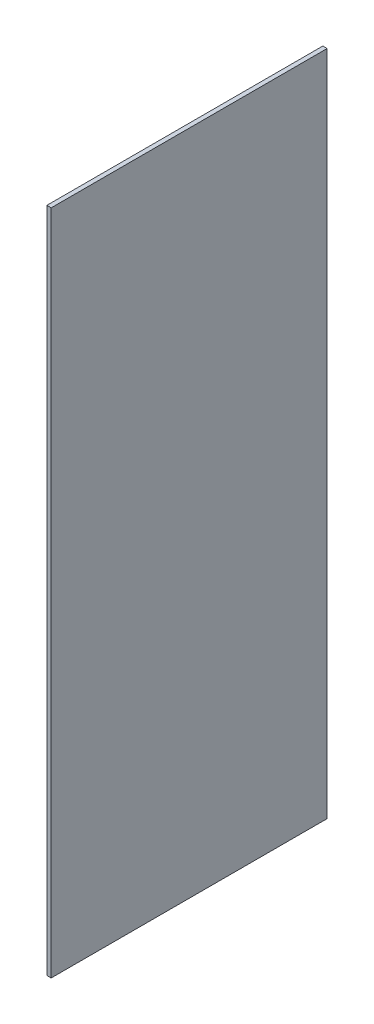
ISO-10303-21;
HEADER;
FILE_DESCRIPTION(('STEP AP214'),'2;1');
FILE_NAME('part.step','',(''),(''),'','','');
FILE_SCHEMA(('AUTOMOTIVE_DESIGN { 1 0 10303 214 1 1 1 1 }'));
ENDSEC;
DATA;
#1=APPLICATION_CONTEXT('core data for automotive mechanical design processes');
#2=APPLICATION_PROTOCOL_DEFINITION('international standard','automotive_design',2000,#1);
#3=PRODUCT_CONTEXT('',#1,'mechanical');
#4=PRODUCT('Part','Part','',(#3));
#5=PRODUCT_RELATED_PRODUCT_CATEGORY('part','',(#4));
#6=PRODUCT_DEFINITION_FORMATION('','',#4);
#7=PRODUCT_DEFINITION_CONTEXT('part definition',#1,'design');
#8=PRODUCT_DEFINITION('design','',#6,#7);
#9=PRODUCT_DEFINITION_SHAPE('','',#8);
#10=(LENGTH_UNIT() NAMED_UNIT(*) SI_UNIT(.MILLI.,.METRE.));
#11=(NAMED_UNIT(*) PLANE_ANGLE_UNIT() SI_UNIT($,.RADIAN.));
#12=(NAMED_UNIT(*) SI_UNIT($,.STERADIAN.) SOLID_ANGLE_UNIT());
#13=UNCERTAINTY_MEASURE_WITH_UNIT(LENGTH_MEASURE(1.E-05),#10,'distance_accuracy_value','');
#14=(GEOMETRIC_REPRESENTATION_CONTEXT(3) GLOBAL_UNCERTAINTY_ASSIGNED_CONTEXT((#13)) GLOBAL_UNIT_ASSIGNED_CONTEXT((#10,
#11,#12)) REPRESENTATION_CONTEXT('',''));
#15=CARTESIAN_POINT('',(0.,0.,0.));
#16=DIRECTION('',(0.,0.,1.));
#17=DIRECTION('',(1.,0.,0.));
#18=AXIS2_PLACEMENT_3D('',#15,#16,#17);
#19=CARTESIAN_POINT('',(-4.76249999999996,1473.2,304.8));
#20=DIRECTION('',(1.,0.,0.));
#21=DIRECTION('',(0.,0.,-1.));
#22=AXIS2_PLACEMENT_3D('',#19,#20,#21);
#23=PLANE('',#22);
#24=DIRECTION('',(0.,0.,1.));
#25=VECTOR('',#24,1.);
#26=CARTESIAN_POINT('',(-4.76249999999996,0.,304.8));
#27=LINE('',#26,#25);
#28=CARTESIAN_POINT('',(-4.76250000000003,0.,-304.8));
#29=VERTEX_POINT('',#28);
#30=CARTESIAN_POINT('',(-4.76249999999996,0.,304.8));
#31=VERTEX_POINT('',#30);
#32=EDGE_CURVE('E113',#29,#31,#27,.T.);
#33=ORIENTED_EDGE('',*,*,#32,.T.);
#34=DIRECTION('',(0.,-1.,0.));
#35=VECTOR('',#34,1.);
#36=CARTESIAN_POINT('',(-4.76249999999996,1473.2,304.8));
#37=LINE('',#36,#35);
#38=CARTESIAN_POINT('',(-4.76249999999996,1473.2,304.8));
#39=VERTEX_POINT('',#38);
#40=EDGE_CURVE('E11',#39,#31,#37,.T.);
#41=ORIENTED_EDGE('',*,*,#40,.F.);
#42=DIRECTION('',(0.,0.,1.));
#43=VECTOR('',#42,1.);
#44=CARTESIAN_POINT('',(-4.76249999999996,1473.2,304.8));
#45=LINE('',#44,#43);
#46=CARTESIAN_POINT('',(-4.76250000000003,1473.2,-304.8));
#47=VERTEX_POINT('',#46);
#48=EDGE_CURVE('E97',#47,#39,#45,.T.);
#49=ORIENTED_EDGE('',*,*,#48,.F.);
#50=DIRECTION('',(0.,-1.,0.));
#51=VECTOR('',#50,1.);
#52=CARTESIAN_POINT('',(-4.76250000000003,1473.2,-304.8));
#53=LINE('',#52,#51);
#54=EDGE_CURVE('E107',#47,#29,#53,.T.);
#55=ORIENTED_EDGE('',*,*,#54,.T.);
#56=EDGE_LOOP('',(#33,#41,#49,#55));
#57=FACE_BOUND('',#56,.T.);
#58=ADVANCED_FACE('F44',(#57),#23,.F.);
#59=CARTESIAN_POINT('',(4.76250000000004,1473.2,304.8));
#60=DIRECTION('',(0.,0.,-1.));
#61=DIRECTION('',(-1.,0.,0.));
#62=AXIS2_PLACEMENT_3D('',#59,#60,#61);
#63=PLANE('',#62);
#64=DIRECTION('',(1.,0.,0.));
#65=VECTOR('',#64,1.);
#66=CARTESIAN_POINT('',(4.76250000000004,0.,304.8));
#67=LINE('',#66,#65);
#68=CARTESIAN_POINT('',(4.76250000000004,0.,304.8));
#69=VERTEX_POINT('',#68);
#70=EDGE_CURVE('E105',#31,#69,#67,.T.);
#71=ORIENTED_EDGE('',*,*,#70,.T.);
#72=DIRECTION('',(0.,-1.,0.));
#73=VECTOR('',#72,1.);
#74=CARTESIAN_POINT('',(4.76250000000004,1473.2,304.8));
#75=LINE('',#74,#73);
#76=CARTESIAN_POINT('',(4.76250000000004,1473.2,304.8));
#77=VERTEX_POINT('',#76);
#78=EDGE_CURVE('E53',#77,#69,#75,.T.);
#79=ORIENTED_EDGE('',*,*,#78,.F.);
#80=DIRECTION('',(1.,0.,0.));
#81=VECTOR('',#80,1.);
#82=CARTESIAN_POINT('',(4.76250000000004,1473.2,304.8));
#83=LINE('',#82,#81);
#84=EDGE_CURVE('E95',#39,#77,#83,.T.);
#85=ORIENTED_EDGE('',*,*,#84,.F.);
#86=ORIENTED_EDGE('',*,*,#40,.T.);
#87=EDGE_LOOP('',(#71,#79,#85,#86));
#88=FACE_BOUND('',#87,.T.);
#89=ADVANCED_FACE('F103',(#88),#63,.F.);
#90=CARTESIAN_POINT('',(4.76250000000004,1473.2,304.8));
#91=DIRECTION('',(-1.,0.,0.));
#92=DIRECTION('',(0.,0.,1.));
#93=AXIS2_PLACEMENT_3D('',#90,#91,#92);
#94=PLANE('',#93);
#95=DIRECTION('',(0.,0.,-1.));
#96=VECTOR('',#95,1.);
#97=CARTESIAN_POINT('',(4.76250000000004,0.,304.8));
#98=LINE('',#97,#96);
#99=CARTESIAN_POINT('',(4.76249999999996,0.,-304.8));
#100=VERTEX_POINT('',#99);
#101=EDGE_CURVE('E79',#69,#100,#98,.T.);
#102=ORIENTED_EDGE('',*,*,#101,.T.);
#103=DIRECTION('',(0.,-1.,0.));
#104=VECTOR('',#103,1.);
#105=CARTESIAN_POINT('',(4.76249999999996,1473.2,-304.8));
#106=LINE('',#105,#104);
#107=CARTESIAN_POINT('',(4.76249999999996,1473.2,-304.8));
#108=VERTEX_POINT('',#107);
#109=EDGE_CURVE('E104',#108,#100,#106,.T.);
#110=ORIENTED_EDGE('',*,*,#109,.F.);
#111=DIRECTION('',(0.,0.,-1.));
#112=VECTOR('',#111,1.);
#113=CARTESIAN_POINT('',(4.76250000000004,1473.2,304.8));
#114=LINE('',#113,#112);
#115=EDGE_CURVE('E93',#77,#108,#114,.T.);
#116=ORIENTED_EDGE('',*,*,#115,.F.);
#117=ORIENTED_EDGE('',*,*,#78,.T.);
#118=EDGE_LOOP('',(#102,#110,#116,#117));
#119=FACE_BOUND('',#118,.T.);
#120=ADVANCED_FACE('F102',(#119),#94,.F.);
#121=CARTESIAN_POINT('',(4.76249999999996,1473.2,-304.8));
#122=DIRECTION('',(0.,0.,1.));
#123=DIRECTION('',(1.,0.,0.));
#124=AXIS2_PLACEMENT_3D('',#121,#122,#123);
#125=PLANE('',#124);
#126=DIRECTION('',(-1.,0.,0.));
#127=VECTOR('',#126,1.);
#128=CARTESIAN_POINT('',(4.76249999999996,0.,-304.8));
#129=LINE('',#128,#127);
#130=EDGE_CURVE('E83',#100,#29,#129,.T.);
#131=ORIENTED_EDGE('',*,*,#130,.T.);
#132=ORIENTED_EDGE('',*,*,#54,.F.);
#133=DIRECTION('',(-1.,0.,0.));
#134=VECTOR('',#133,1.);
#135=CARTESIAN_POINT('',(4.76249999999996,1473.2,-304.8));
#136=LINE('',#135,#134);
#137=EDGE_CURVE('E65',#108,#47,#136,.T.);
#138=ORIENTED_EDGE('',*,*,#137,.F.);
#139=ORIENTED_EDGE('',*,*,#109,.T.);
#140=EDGE_LOOP('',(#131,#132,#138,#139));
#141=FACE_BOUND('',#140,.T.);
#142=ADVANCED_FACE('F127',(#141),#125,.F.);
#143=CARTESIAN_POINT('',(0.,1473.2,0.));
#144=DIRECTION('',(0.,1.,0.));
#145=DIRECTION('',(0.,0.,1.));
#146=AXIS2_PLACEMENT_3D('',#143,#144,#145);
#147=PLANE('',#146);
#148=ORIENTED_EDGE('',*,*,#48,.T.);
#149=ORIENTED_EDGE('',*,*,#84,.T.);
#150=ORIENTED_EDGE('',*,*,#115,.T.);
#151=ORIENTED_EDGE('',*,*,#137,.T.);
#152=EDGE_LOOP('',(#148,#149,#150,#151));
#153=FACE_BOUND('',#152,.T.);
#154=ADVANCED_FACE('F94',(#153),#147,.T.);
#155=CARTESIAN_POINT('',(0.,0.,0.));
#156=DIRECTION('',(0.,1.,0.));
#157=DIRECTION('',(0.,0.,1.));
#158=AXIS2_PLACEMENT_3D('',#155,#156,#157);
#159=PLANE('',#158);
#160=ORIENTED_EDGE('',*,*,#32,.F.);
#161=ORIENTED_EDGE('',*,*,#130,.F.);
#162=ORIENTED_EDGE('',*,*,#101,.F.);
#163=ORIENTED_EDGE('',*,*,#70,.F.);
#164=EDGE_LOOP('',(#160,#161,#162,#163));
#165=FACE_BOUND('',#164,.T.);
#166=ADVANCED_FACE('F126',(#165),#159,.F.);
#167=CLOSED_SHELL('',(#58,#89,#120,#142,#154,#166));
#168=MANIFOLD_SOLID_BREP('B2',#167);
#169=ADVANCED_BREP_SHAPE_REPRESENTATION('',(#18,#168),#14);
#170=SHAPE_DEFINITION_REPRESENTATION(#9,#169);
ENDSEC;
END-ISO-10303-21;
